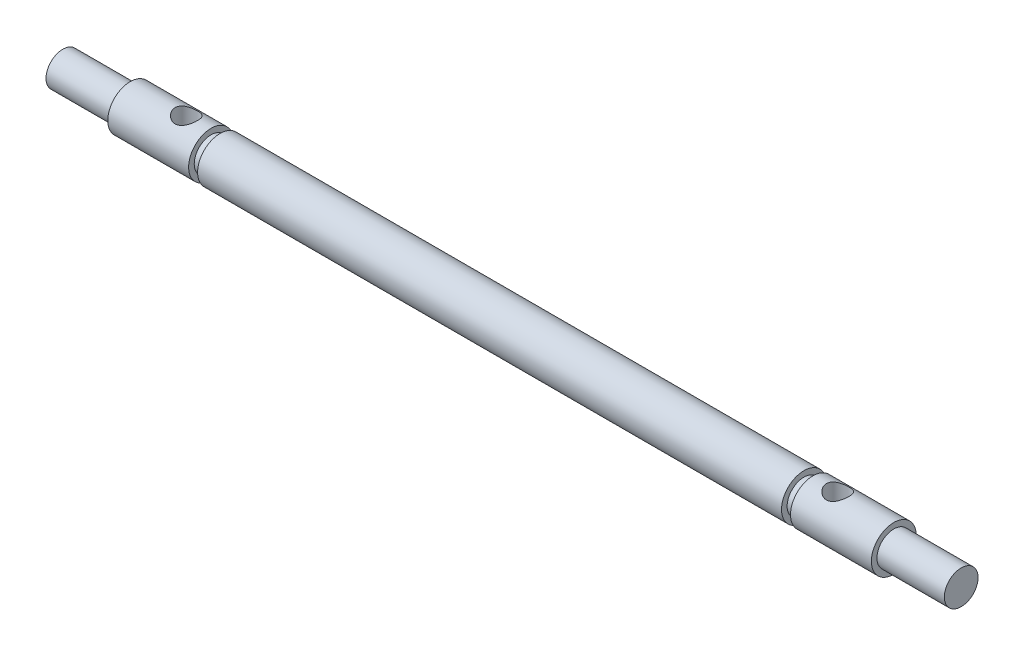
from build123d import *

# Parameters (mm, degrees)
SKETCH_2_R          = 1
CUT_EXTRUDE_1_DEPTH = 41.099875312


with BuildPart() as part:
    # Sketch 1 → Revolve 1 (revolve)
    with BuildSketch(Plane(origin=(0, 0, 0), x_dir=(1, 0, 0), z_dir=(0, 1, 0)), mode=Mode.PRIVATE) as revolve_1_sk:
        Polygon((26.8, 2), (34, 2), (34, 1.5), (40, 1.5), (40, 0), (0, 0), (0, 2), (26, 2), (26, 1.5), (26.8, 1.5), align=None)
    revolve_1 = revolve(revolve_1_sk.sketch.rotate(Axis((0, 0, 0), (1, 0, 0)), 180), axis=Axis((0, 0, 0), (1, 0, 0)))

    # Sketch 2 → Cut-Extrude 1 (cut, symmetric)
    with BuildSketch(Plane(origin=(0, 0, 0), x_dir=(1, 0, 0), z_dir=(0, 1, 0))):
        with Locations(Location((29, 0, 0), (0, 0, 270))):
            Circle(SKETCH_2_R)
    cut_extrude_1 = extrude(amount=CUT_EXTRUDE_1_DEPTH, both=True, mode=Mode.SUBTRACT)

    # Mirror 1: Revolve 1, Cut-Extrude 1 across plane
    add(revolve_1.mirror(Plane(origin=(0, 0, 0), x_dir=(0, 0, 1), z_dir=(1, 0, 0))))
    add(cut_extrude_1.mirror(Plane(origin=(0, 0, 0), x_dir=(0, 0, 1), z_dir=(1, 0, 0))), mode=Mode.SUBTRACT)


solid = part.part
